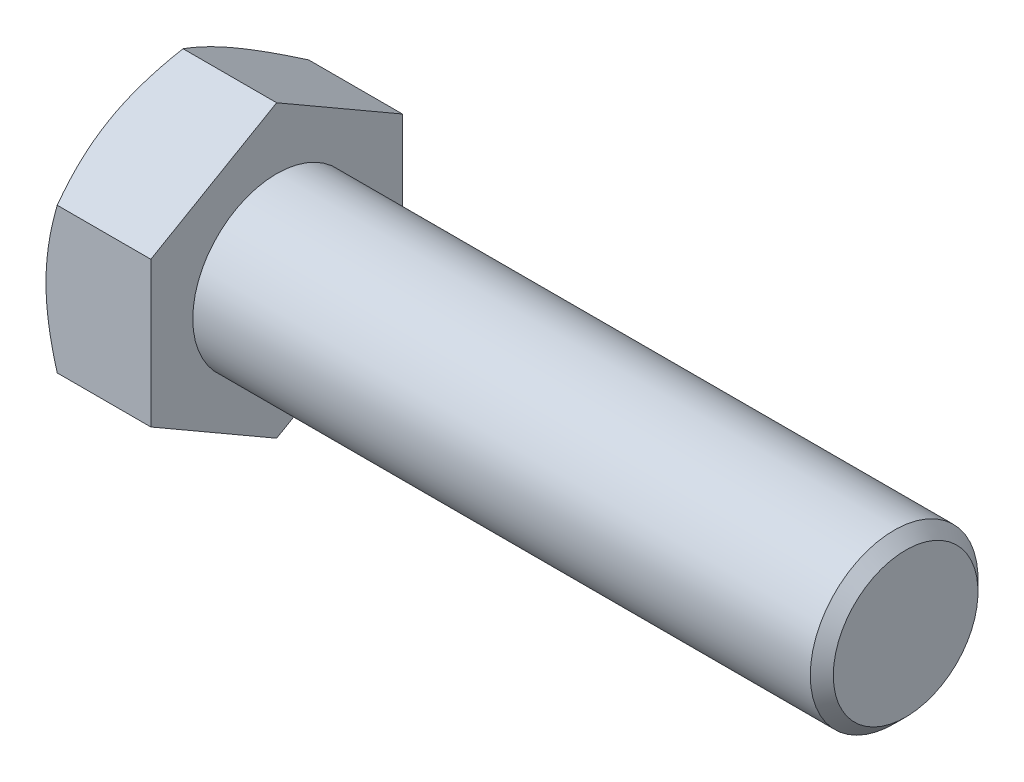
ISO-10303-21;
HEADER;
FILE_DESCRIPTION(('STEP AP214'),'2;1');
FILE_NAME('part.step','',(''),(''),'','','');
FILE_SCHEMA(('AUTOMOTIVE_DESIGN { 1 0 10303 214 1 1 1 1 }'));
ENDSEC;
DATA;
#1=APPLICATION_CONTEXT('core data for automotive mechanical design processes');
#2=APPLICATION_PROTOCOL_DEFINITION('international standard','automotive_design',2000,#1);
#3=PRODUCT_CONTEXT('',#1,'mechanical');
#4=PRODUCT('Part','Part','',(#3));
#5=PRODUCT_RELATED_PRODUCT_CATEGORY('part','',(#4));
#6=PRODUCT_DEFINITION_FORMATION('','',#4);
#7=PRODUCT_DEFINITION_CONTEXT('part definition',#1,'design');
#8=PRODUCT_DEFINITION('design','',#6,#7);
#9=PRODUCT_DEFINITION_SHAPE('','',#8);
#10=(LENGTH_UNIT() NAMED_UNIT(*) SI_UNIT(.MILLI.,.METRE.));
#11=(NAMED_UNIT(*) PLANE_ANGLE_UNIT() SI_UNIT($,.RADIAN.));
#12=(NAMED_UNIT(*) SI_UNIT($,.STERADIAN.) SOLID_ANGLE_UNIT());
#13=UNCERTAINTY_MEASURE_WITH_UNIT(LENGTH_MEASURE(1.E-05),#10,'distance_accuracy_value','');
#14=(GEOMETRIC_REPRESENTATION_CONTEXT(3) GLOBAL_UNCERTAINTY_ASSIGNED_CONTEXT((#13)) GLOBAL_UNIT_ASSIGNED_CONTEXT((#10,
#11,#12)) REPRESENTATION_CONTEXT('',''));
#15=CARTESIAN_POINT('',(0.,0.,0.));
#16=DIRECTION('',(0.,0.,1.));
#17=DIRECTION('',(1.,0.,0.));
#18=AXIS2_PLACEMENT_3D('',#15,#16,#17);
#19=CARTESIAN_POINT('',(15.,31.1769145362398,18.));
#20=DIRECTION('',(1.,0.,0.));
#21=DIRECTION('',(0.,0.,-1.));
#22=AXIS2_PLACEMENT_3D('',#19,#20,#21);
#23=PLANE('',#22);
#24=DIRECTION('',(0.,0.5,0.866025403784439));
#25=VECTOR('',#24,1.);
#26=CARTESIAN_POINT('',(15.,10.3923048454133,-18.));
#27=LINE('',#26,#25);
#28=CARTESIAN_POINT('',(15.,10.3923048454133,-18.));
#29=VERTEX_POINT('',#28);
#30=CARTESIAN_POINT('',(15.,20.7846096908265,0.));
#31=VERTEX_POINT('',#30);
#32=EDGE_CURVE('E150',#29,#31,#27,.T.);
#33=ORIENTED_EDGE('',*,*,#32,.T.);
#34=DIRECTION('',(0.,-0.5,0.866025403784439));
#35=VECTOR('',#34,1.);
#36=CARTESIAN_POINT('',(15.,20.7846096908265,0.));
#37=LINE('',#36,#35);
#38=CARTESIAN_POINT('',(15.,10.3923048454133,18.));
#39=VERTEX_POINT('',#38);
#40=EDGE_CURVE('E148',#31,#39,#37,.T.);
#41=ORIENTED_EDGE('',*,*,#40,.T.);
#42=DIRECTION('',(0.,-1.,0.));
#43=VECTOR('',#42,1.);
#44=CARTESIAN_POINT('',(15.,10.3923048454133,18.));
#45=LINE('',#44,#43);
#46=CARTESIAN_POINT('',(15.,-10.3923048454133,18.));
#47=VERTEX_POINT('',#46);
#48=EDGE_CURVE('E125',#39,#47,#45,.T.);
#49=ORIENTED_EDGE('',*,*,#48,.T.);
#50=DIRECTION('',(0.,-0.5,-0.866025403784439));
#51=VECTOR('',#50,1.);
#52=CARTESIAN_POINT('',(15.,-10.3923048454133,18.));
#53=LINE('',#52,#51);
#54=CARTESIAN_POINT('',(15.,-20.7846096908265,0.));
#55=VERTEX_POINT('',#54);
#56=EDGE_CURVE('E145',#47,#55,#53,.T.);
#57=ORIENTED_EDGE('',*,*,#56,.T.);
#58=DIRECTION('',(0.,0.5,-0.866025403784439));
#59=VECTOR('',#58,1.);
#60=CARTESIAN_POINT('',(15.,-20.7846096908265,0.));
#61=LINE('',#60,#59);
#62=CARTESIAN_POINT('',(15.,-10.3923048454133,-18.));
#63=VERTEX_POINT('',#62);
#64=EDGE_CURVE('E143',#55,#63,#61,.T.);
#65=ORIENTED_EDGE('',*,*,#64,.T.);
#66=DIRECTION('',(0.,1.,0.));
#67=VECTOR('',#66,1.);
#68=CARTESIAN_POINT('',(15.,-10.3923048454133,-18.));
#69=LINE('',#68,#67);
#70=EDGE_CURVE('E141',#63,#29,#69,.T.);
#71=ORIENTED_EDGE('',*,*,#70,.T.);
#72=EDGE_LOOP('',(#33,#41,#49,#57,#65,#71));
#73=FACE_BOUND('',#72,.T.);
#74=CARTESIAN_POINT('',(15.,0.,0.));
#75=DIRECTION('',(1.,0.,0.));
#76=DIRECTION('',(0.,0.,-1.));
#77=AXIS2_PLACEMENT_3D('',#74,#75,#76);
#78=CIRCLE('',#77,12.);
#79=CARTESIAN_POINT('',(15.,0.,-12.));
#80=VERTEX_POINT('',#79);
#81=EDGE_CURVE('E237',#80,#80,#78,.F.);
#82=ORIENTED_EDGE('',*,*,#81,.T.);
#83=EDGE_LOOP('',(#82));
#84=FACE_BOUND('',#83,.T.);
#85=ADVANCED_FACE('F32',(#73,#84),#23,.T.);
#86=CARTESIAN_POINT('',(15.,10.3923048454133,-18.));
#87=DIRECTION('',(0.,-0.866025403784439,0.5));
#88=DIRECTION('',(0.,-0.5,-0.866025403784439));
#89=AXIS2_PLACEMENT_3D('',#86,#87,#88);
#90=PLANE('',#89);
#91=CARTESIAN_POINT('',(1.60776182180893,20.7847251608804,0.000199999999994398));
#92=CARTESIAN_POINT('',(1.47589336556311,20.5563065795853,-0.395432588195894));
#93=CARTESIAN_POINT('',(1.35000889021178,20.3269970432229,-0.792608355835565));
#94=CARTESIAN_POINT('',(1.11187123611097,19.8665391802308,-1.59014476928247));
#95=CARTESIAN_POINT('',(0.999622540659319,19.6353902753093,-1.99050641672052));
#96=CARTESIAN_POINT('',(0.790265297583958,19.1708069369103,-2.79518836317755));
#97=CARTESIAN_POINT('',(0.693192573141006,18.9373684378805,-3.19951570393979));
#98=CARTESIAN_POINT('',(0.516271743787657,18.4688693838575,-4.01097986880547));
#99=CARTESIAN_POINT('',(0.436422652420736,18.2338089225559,-4.41811653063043));
#100=CARTESIAN_POINT('',(0.297345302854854,17.7680889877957,-5.22476711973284));
#101=CARTESIAN_POINT('',(0.237656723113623,17.537464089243,-5.62422116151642));
#102=CARTESIAN_POINT('',(0.137572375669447,17.0751575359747,-6.42495960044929));
#103=CARTESIAN_POINT('',(0.0971769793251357,16.8434758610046,-6.82624403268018));
#104=CARTESIAN_POINT('',(0.0366989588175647,16.3797233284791,-7.62948698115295));
#105=CARTESIAN_POINT('',(0.0165921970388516,16.1476532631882,-8.03144412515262));
#106=CARTESIAN_POINT('',(-0.00287614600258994,15.6832989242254,-8.83572943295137));
#107=CARTESIAN_POINT('',(-0.00223836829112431,15.4510146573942,-9.23805758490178));
#108=CARTESIAN_POINT('',(0.0183335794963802,15.0167538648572,-9.99021934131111));
#109=CARTESIAN_POINT('',(0.0357591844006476,14.8147463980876,-10.3401065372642));
#110=CARTESIAN_POINT('',(0.0859690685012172,14.4112133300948,-11.0390463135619));
#111=CARTESIAN_POINT('',(0.118753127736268,14.209687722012,-11.3880989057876));
#112=CARTESIAN_POINT('',(0.199111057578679,13.8071947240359,-12.0852372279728));
#113=CARTESIAN_POINT('',(0.246698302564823,13.6062280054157,-12.4333217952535));
#114=CARTESIAN_POINT('',(0.355822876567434,13.2052512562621,-13.1278338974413));
#115=CARTESIAN_POINT('',(0.417360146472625,13.0052412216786,-13.4742614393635));
#116=CARTESIAN_POINT('',(0.62446207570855,12.3980849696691,-14.525886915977));
#117=CARTESIAN_POINT('',(0.790677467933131,11.99269701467,-15.228039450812));
#118=CARTESIAN_POINT('',(1.16791817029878,11.1879658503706,-16.6218747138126));
#119=CARTESIAN_POINT('',(1.37885488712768,10.78861233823,-17.3135752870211));
#120=CARTESIAN_POINT('',(1.60776182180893,10.3921893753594,-18.0002));
#121=B_SPLINE_CURVE_WITH_KNOTS('',3,(#91,#92,#93,#94,#95,#96,#97,#98,#99,#100,#101,#102,#103,
#104,#105,#106,#107,#108,#109,#110,#111,#112,#113,#114,#115,#116,#117,#118,#119,#120),
.UNSPECIFIED.,.F.,.F.,(4,2,2,2,2,2,2,2,2,2,2,2,2,2,4),(0.,1.42650335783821,2.85347447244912,
4.28376471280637,5.71397301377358,7.10888071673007,8.5038152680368,9.89708828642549,
11.2903182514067,12.5031974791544,13.7160593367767,14.9300201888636,16.1439758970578,
18.6253607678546,21.1018751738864),.UNSPECIFIED.);
#122=CARTESIAN_POINT('',(1.60769515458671,20.7846096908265,0.));
#123=VERTEX_POINT('',#122);
#124=CARTESIAN_POINT('',(0.,15.5884572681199,-9.));
#125=VERTEX_POINT('',#124);
#126=EDGE_CURVE('E49',#123,#125,#121,.T.);
#127=ORIENTED_EDGE('',*,*,#126,.F.);
#128=DIRECTION('',(-1.,0.,0.));
#129=VECTOR('',#128,1.);
#130=CARTESIAN_POINT('',(15.,20.7846096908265,0.));
#131=LINE('',#130,#129);
#132=EDGE_CURVE('E126',#31,#123,#131,.T.);
#133=ORIENTED_EDGE('',*,*,#132,.F.);
#134=ORIENTED_EDGE('',*,*,#32,.F.);
#135=DIRECTION('',(-1.,0.,0.));
#136=VECTOR('',#135,1.);
#137=CARTESIAN_POINT('',(15.,10.3923048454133,-18.));
#138=LINE('',#137,#136);
#139=CARTESIAN_POINT('',(1.60769515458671,10.3923048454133,-18.));
#140=VERTEX_POINT('',#139);
#141=EDGE_CURVE('E138',#29,#140,#138,.T.);
#142=ORIENTED_EDGE('',*,*,#141,.T.);
#143=EDGE_CURVE('E193',#125,#140,#121,.T.);
#144=ORIENTED_EDGE('',*,*,#143,.F.);
#145=EDGE_LOOP('',(#127,#133,#134,#142,#144));
#146=FACE_BOUND('',#145,.T.);
#147=ADVANCED_FACE('F34',(#146),#90,.F.);
#148=CARTESIAN_POINT('',(15.,20.7846096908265,0.));
#149=DIRECTION('',(0.,-0.866025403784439,-0.5));
#150=DIRECTION('',(0.,0.5,-0.866025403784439));
#151=AXIS2_PLACEMENT_3D('',#148,#149,#150);
#152=PLANE('',#151);
#153=CARTESIAN_POINT('',(1.60776182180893,10.3921893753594,18.0002));
#154=CARTESIAN_POINT('',(1.47589336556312,10.6206079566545,17.6045674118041));
#155=CARTESIAN_POINT('',(1.35000889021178,10.8499174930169,17.2073916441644));
#156=CARTESIAN_POINT('',(1.11187123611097,11.310375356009,16.4098552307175));
#157=CARTESIAN_POINT('',(0.999622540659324,11.5415242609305,16.0094935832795));
#158=CARTESIAN_POINT('',(0.790265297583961,12.0061075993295,15.2048116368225));
#159=CARTESIAN_POINT('',(0.693192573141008,12.2395460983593,14.8004842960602));
#160=CARTESIAN_POINT('',(0.51627174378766,12.7080451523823,13.9890201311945));
#161=CARTESIAN_POINT('',(0.436422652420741,12.9431056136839,13.5818834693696));
#162=CARTESIAN_POINT('',(0.297345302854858,13.4088255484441,12.7752328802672));
#163=CARTESIAN_POINT('',(0.237656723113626,13.6394504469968,12.3757788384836));
#164=CARTESIAN_POINT('',(0.137572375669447,14.1017570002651,11.5750403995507));
#165=CARTESIAN_POINT('',(0.0971769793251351,14.3334386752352,11.1737559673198));
#166=CARTESIAN_POINT('',(0.0366989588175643,14.7971912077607,10.3705130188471));
#167=CARTESIAN_POINT('',(0.0165921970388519,15.0292612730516,9.96855587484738));
#168=CARTESIAN_POINT('',(-0.00287614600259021,15.4936156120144,9.16427056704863));
#169=CARTESIAN_POINT('',(-0.0022383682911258,15.7258998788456,8.76194241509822));
#170=CARTESIAN_POINT('',(0.0183335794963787,16.1601606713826,8.00978065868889));
#171=CARTESIAN_POINT('',(0.035759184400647,16.3621681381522,7.65989346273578));
#172=CARTESIAN_POINT('',(0.0859690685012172,16.765701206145,6.96095368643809));
#173=CARTESIAN_POINT('',(0.118753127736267,16.9672268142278,6.61190109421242));
#174=CARTESIAN_POINT('',(0.199111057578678,17.3697198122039,5.91476277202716));
#175=CARTESIAN_POINT('',(0.246698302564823,17.5706865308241,5.56667820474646));
#176=CARTESIAN_POINT('',(0.355822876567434,17.9716632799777,4.87216610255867));
#177=CARTESIAN_POINT('',(0.417360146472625,18.1716733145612,4.52573856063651));
#178=CARTESIAN_POINT('',(0.624462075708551,18.7788295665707,3.47411308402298));
#179=CARTESIAN_POINT('',(0.790677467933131,19.1842175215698,2.77196054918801));
#180=CARTESIAN_POINT('',(1.16791817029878,19.9889486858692,1.37812528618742));
#181=CARTESIAN_POINT('',(1.37885488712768,20.3883021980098,0.68642471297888));
#182=CARTESIAN_POINT('',(1.60776182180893,20.7847251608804,-0.000200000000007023));
#183=B_SPLINE_CURVE_WITH_KNOTS('',3,(#153,#154,#155,#156,#157,#158,#159,#160,#161,#162,#163,
#164,#165,#166,#167,#168,#169,#170,#171,#172,#173,#174,#175,#176,#177,#178,#179,#180,#181,#182),
.UNSPECIFIED.,.F.,.F.,(4,2,2,2,2,2,2,2,2,2,2,2,2,2,4),(0.,1.42650335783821,2.85347447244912,
4.28376471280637,5.71397301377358,7.10888071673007,8.5038152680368,9.89708828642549,
11.2903182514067,12.5031974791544,13.7160593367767,14.9300201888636,16.1439758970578,
18.6253607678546,21.1018751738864),.UNSPECIFIED.);
#184=CARTESIAN_POINT('',(1.60769515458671,10.3923048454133,18.));
#185=VERTEX_POINT('',#184);
#186=CARTESIAN_POINT('',(0.,15.5884572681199,8.99999999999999));
#187=VERTEX_POINT('',#186);
#188=EDGE_CURVE('E56',#185,#187,#183,.T.);
#189=ORIENTED_EDGE('',*,*,#188,.F.);
#190=DIRECTION('',(-1.,0.,0.));
#191=VECTOR('',#190,1.);
#192=CARTESIAN_POINT('',(15.,10.3923048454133,18.));
#193=LINE('',#192,#191);
#194=EDGE_CURVE('E118',#39,#185,#193,.T.);
#195=ORIENTED_EDGE('',*,*,#194,.F.);
#196=ORIENTED_EDGE('',*,*,#40,.F.);
#197=ORIENTED_EDGE('',*,*,#132,.T.);
#198=EDGE_CURVE('E121',#187,#123,#183,.T.);
#199=ORIENTED_EDGE('',*,*,#198,.F.);
#200=EDGE_LOOP('',(#189,#195,#196,#197,#199));
#201=FACE_BOUND('',#200,.T.);
#202=ADVANCED_FACE('F117',(#201),#152,.F.);
#203=CARTESIAN_POINT('',(15.,10.3923048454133,18.));
#204=DIRECTION('',(0.,0.,-1.));
#205=DIRECTION('',(-1.,0.,0.));
#206=AXIS2_PLACEMENT_3D('',#203,#204,#205);
#207=PLANE('',#206);
#208=CARTESIAN_POINT('',(8.61348069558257,-27.5619239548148,18.));
#209=CARTESIAN_POINT('',(8.42247770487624,-27.1667877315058,18.));
#210=CARTESIAN_POINT('',(8.23246323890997,-26.7711739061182,18.));
#211=CARTESIAN_POINT('',(7.85463825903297,-25.978890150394,18.));
#212=CARTESIAN_POINT('',(7.66682776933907,-25.5822202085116,18.));
#213=CARTESIAN_POINT('',(7.10698821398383,-24.3903587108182,18.));
#214=CARTESIAN_POINT('',(6.73861331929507,-23.5934439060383,18.));
#215=CARTESIAN_POINT('',(6.0118783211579,-21.9895471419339,18.));
#216=CARTESIAN_POINT('',(5.65358759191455,-21.1825336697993,18.));
#217=CARTESIAN_POINT('',(4.95238944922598,-19.5618746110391,18.));
#218=CARTESIAN_POINT('',(4.60948123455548,-18.7482293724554,18.));
#219=CARTESIAN_POINT('',(3.93907746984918,-17.1029123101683,18.));
#220=CARTESIAN_POINT('',(3.61182282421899,-16.2711418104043,18.));
#221=CARTESIAN_POINT('',(2.98294292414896,-14.597784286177,18.));
#222=CARTESIAN_POINT('',(2.68132051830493,-13.7561961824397,18.));
#223=CARTESIAN_POINT('',(2.11181367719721,-12.0636207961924,18.));
#224=CARTESIAN_POINT('',(1.84385751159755,-11.2126578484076,18.));
#225=CARTESIAN_POINT('',(1.35037221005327,-9.49855213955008,18.));
#226=CARTESIAN_POINT('',(1.12482967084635,-8.63541331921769,18.));
#227=CARTESIAN_POINT('',(0.826582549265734,-7.33140916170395,18.));
#228=CARTESIAN_POINT('',(0.733829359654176,-6.89509921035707,18.));
#229=CARTESIAN_POINT('',(0.563143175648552,-6.01957542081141,18.));
#230=CARTESIAN_POINT('',(0.485209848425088,-5.58036164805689,18.));
#231=CARTESIAN_POINT('',(0.345545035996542,-4.6993249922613,18.));
#232=CARTESIAN_POINT('',(0.283814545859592,-4.25750195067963,18.));
#233=CARTESIAN_POINT('',(0.177795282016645,-3.37175302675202,18.));
#234=CARTESIAN_POINT('',(0.133506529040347,-2.92782714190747,18.));
#235=CARTESIAN_POINT('',(0.063563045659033,-2.04133804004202,18.));
#236=CARTESIAN_POINT('',(0.0377917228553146,-1.598784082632,18.));
#237=CARTESIAN_POINT('',(0.0050185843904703,-0.712983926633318,18.));
#238=CARTESIAN_POINT('',(-0.00198351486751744,-0.269737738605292,18.));
#239=CARTESIAN_POINT('',(0.00294785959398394,0.616528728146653,18.));
#240=CARTESIAN_POINT('',(0.0148760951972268,1.05954903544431,18.));
#241=CARTESIAN_POINT('',(0.0573715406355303,1.9446967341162,18.));
#242=CARTESIAN_POINT('',(0.0879395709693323,2.38682408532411,18.));
#243=CARTESIAN_POINT('',(0.183949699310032,3.45808110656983,18.));
#244=CARTESIAN_POINT('',(0.258712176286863,4.08639173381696,18.));
#245=CARTESIAN_POINT('',(0.441718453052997,5.33809089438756,18.));
#246=CARTESIAN_POINT('',(0.549967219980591,5.96147868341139,18.));
#247=CARTESIAN_POINT('',(0.919513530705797,7.82534534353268,18.));
#248=CARTESIAN_POINT('',(1.22536507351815,9.05709271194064,18.));
#249=CARTESIAN_POINT('',(1.75275444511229,10.8995809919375,18.));
#250=CARTESIAN_POINT('',(1.94256699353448,11.5199484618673,18.));
#251=CARTESIAN_POINT('',(2.34111719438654,12.7546900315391,18.));
#252=CARTESIAN_POINT('',(2.54985655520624,13.3690635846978,18.));
#253=CARTESIAN_POINT('',(2.98181266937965,14.5887549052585,18.));
#254=CARTESIAN_POINT('',(3.20494114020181,15.1941042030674,18.));
#255=CARTESIAN_POINT('',(3.54929436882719,16.0983156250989,18.));
#256=CARTESIAN_POINT('',(3.66566915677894,16.3990354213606,18.));
#257=CARTESIAN_POINT('',(3.90137756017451,16.9993068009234,18.));
#258=CARTESIAN_POINT('',(4.0207111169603,17.298858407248,18.));
#259=CARTESIAN_POINT('',(4.14139052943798,17.5978664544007,18.));
#260=B_SPLINE_CURVE_WITH_KNOTS('',3,(#208,#209,#210,#211,#212,#213,#214,#215,#216,#217,#218,
#219,#220,#221,#222,#223,#224,#225,#226,#227,#228,#229,#230,#231,#232,#233,#234,#235,#236,#237,
#238,#239,#240,#241,#242,#243,#244,#245,#246,#247,#248,#249,#250,#251,#252,#253,#254,#255,#256,
#257,#258,#259),.UNSPECIFIED.,.F.,.F.,(4,2,2,2,2,2,2,2,2,2,2,2,2,2,2,2,2,2,2,2,2,2,2,2,2,4),(0.,
1.3166344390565,2.6332833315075,5.26700924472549,7.91580691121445,10.5644664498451,
13.2456434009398,15.9271179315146,18.6027786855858,21.2775924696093,22.6155612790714,
23.9535000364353,25.2915209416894,26.6295434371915,27.9590656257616,29.2885677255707,
30.6177020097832,31.9468948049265,33.8440459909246,35.7414787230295,39.5436531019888,
41.4897689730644,43.4360606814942,45.3713764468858,46.3387197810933,47.3060439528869),.UNSPECIFIED.);
#261=CARTESIAN_POINT('',(1.60769515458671,-10.3923048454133,18.));
#262=VERTEX_POINT('',#261);
#263=CARTESIAN_POINT('',(0.,0.,18.));
#264=VERTEX_POINT('',#263);
#265=EDGE_CURVE('E111',#262,#264,#260,.T.);
#266=ORIENTED_EDGE('',*,*,#265,.F.);
#267=DIRECTION('',(-1.,0.,0.));
#268=VECTOR('',#267,1.);
#269=CARTESIAN_POINT('',(15.,-10.3923048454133,18.));
#270=LINE('',#269,#268);
#271=EDGE_CURVE('E127',#47,#262,#270,.T.);
#272=ORIENTED_EDGE('',*,*,#271,.F.);
#273=ORIENTED_EDGE('',*,*,#48,.F.);
#274=ORIENTED_EDGE('',*,*,#194,.T.);
#275=EDGE_CURVE('E103',#264,#185,#260,.T.);
#276=ORIENTED_EDGE('',*,*,#275,.F.);
#277=EDGE_LOOP('',(#266,#272,#273,#274,#276));
#278=FACE_BOUND('',#277,.T.);
#279=ADVANCED_FACE('F123',(#278),#207,.F.);
#280=CARTESIAN_POINT('',(15.,-10.3923048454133,18.));
#281=DIRECTION('',(0.,0.866025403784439,-0.5));
#282=DIRECTION('',(0.,0.5,0.866025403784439));
#283=AXIS2_PLACEMENT_3D('',#280,#281,#282);
#284=PLANE('',#283);
#285=CARTESIAN_POINT('',(1.60776182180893,-20.7847251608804,-0.000199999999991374));
#286=CARTESIAN_POINT('',(1.47589336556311,-20.5563065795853,0.395432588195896));
#287=CARTESIAN_POINT('',(1.35000889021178,-20.3269970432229,0.792608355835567));
#288=CARTESIAN_POINT('',(1.11187123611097,-19.8665391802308,1.59014476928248));
#289=CARTESIAN_POINT('',(0.999622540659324,-19.6353902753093,1.99050641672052));
#290=CARTESIAN_POINT('',(0.790265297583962,-19.1708069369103,2.79518836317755));
#291=CARTESIAN_POINT('',(0.693192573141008,-18.9373684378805,3.19951570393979));
#292=CARTESIAN_POINT('',(0.51627174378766,-18.4688693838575,4.01097986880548));
#293=CARTESIAN_POINT('',(0.436422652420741,-18.2338089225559,4.41811653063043));
#294=CARTESIAN_POINT('',(0.29734530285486,-17.7680889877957,5.22476711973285));
#295=CARTESIAN_POINT('',(0.237656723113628,-17.537464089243,5.62422116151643));
#296=CARTESIAN_POINT('',(0.137572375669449,-17.0751575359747,6.42495960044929));
#297=CARTESIAN_POINT('',(0.0971769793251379,-16.8434758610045,6.82624403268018));
#298=CARTESIAN_POINT('',(0.0366989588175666,-16.3797233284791,7.62948698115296));
#299=CARTESIAN_POINT('',(0.0165921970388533,-16.1476532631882,8.03144412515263));
#300=CARTESIAN_POINT('',(-0.00287614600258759,-15.6832989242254,8.83572943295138));
#301=CARTESIAN_POINT('',(-0.00223836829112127,-15.4510146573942,9.23805758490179));
#302=CARTESIAN_POINT('',(0.0183335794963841,-15.0167538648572,9.99021934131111));
#303=CARTESIAN_POINT('',(0.0357591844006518,-14.8147463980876,10.3401065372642));
#304=CARTESIAN_POINT('',(0.0859690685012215,-14.4112133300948,11.0390463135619));
#305=CARTESIAN_POINT('',(0.118753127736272,-14.209687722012,11.3880989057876));
#306=CARTESIAN_POINT('',(0.199111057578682,-13.8071947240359,12.0852372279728));
#307=CARTESIAN_POINT('',(0.246698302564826,-13.6062280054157,12.4333217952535));
#308=CARTESIAN_POINT('',(0.355822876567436,-13.2052512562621,13.1278338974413));
#309=CARTESIAN_POINT('',(0.417360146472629,-13.0052412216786,13.4742614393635));
#310=CARTESIAN_POINT('',(0.624462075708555,-12.3980849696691,14.525886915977));
#311=CARTESIAN_POINT('',(0.790677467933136,-11.99269701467,15.228039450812));
#312=CARTESIAN_POINT('',(1.16791817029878,-11.1879658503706,16.6218747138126));
#313=CARTESIAN_POINT('',(1.37885488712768,-10.78861233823,17.3135752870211));
#314=CARTESIAN_POINT('',(1.60776182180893,-10.3921893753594,18.0002));
#315=B_SPLINE_CURVE_WITH_KNOTS('',3,(#285,#286,#287,#288,#289,#290,#291,#292,#293,#294,#295,
#296,#297,#298,#299,#300,#301,#302,#303,#304,#305,#306,#307,#308,#309,#310,#311,#312,#313,#314),
.UNSPECIFIED.,.F.,.F.,(4,2,2,2,2,2,2,2,2,2,2,2,2,2,4),(0.,1.42650335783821,2.85347447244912,
4.28376471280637,5.71397301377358,7.10888071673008,8.5038152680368,9.8970882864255,
11.2903182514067,12.5031974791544,13.7160593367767,14.9300201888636,16.1439758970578,
18.6253607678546,21.1018751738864),.UNSPECIFIED.);
#316=CARTESIAN_POINT('',(1.60769515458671,-20.7846096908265,0.));
#317=VERTEX_POINT('',#316);
#318=CARTESIAN_POINT('',(0.,-15.5884572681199,9.));
#319=VERTEX_POINT('',#318);
#320=EDGE_CURVE('E197',#317,#319,#315,.T.);
#321=ORIENTED_EDGE('',*,*,#320,.F.);
#322=DIRECTION('',(-1.,0.,0.));
#323=VECTOR('',#322,1.);
#324=CARTESIAN_POINT('',(15.,-20.7846096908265,0.));
#325=LINE('',#324,#323);
#326=EDGE_CURVE('E130',#55,#317,#325,.T.);
#327=ORIENTED_EDGE('',*,*,#326,.F.);
#328=ORIENTED_EDGE('',*,*,#56,.F.);
#329=ORIENTED_EDGE('',*,*,#271,.T.);
#330=EDGE_CURVE('E112',#319,#262,#315,.T.);
#331=ORIENTED_EDGE('',*,*,#330,.F.);
#332=EDGE_LOOP('',(#321,#327,#328,#329,#331));
#333=FACE_BOUND('',#332,.T.);
#334=ADVANCED_FACE('F202',(#333),#284,.F.);
#335=CARTESIAN_POINT('',(15.,-20.7846096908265,0.));
#336=DIRECTION('',(0.,0.866025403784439,0.5));
#337=DIRECTION('',(0.,-0.5,0.866025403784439));
#338=AXIS2_PLACEMENT_3D('',#335,#336,#337);
#339=PLANE('',#338);
#340=CARTESIAN_POINT('',(1.60776182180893,-10.3921893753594,-18.0002));
#341=CARTESIAN_POINT('',(1.47589336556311,-10.6206079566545,-17.6045674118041));
#342=CARTESIAN_POINT('',(1.35000889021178,-10.8499174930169,-17.2073916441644));
#343=CARTESIAN_POINT('',(1.11187123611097,-11.310375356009,-16.4098552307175));
#344=CARTESIAN_POINT('',(0.999622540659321,-11.5415242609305,-16.0094935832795));
#345=CARTESIAN_POINT('',(0.790265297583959,-12.0061075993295,-15.2048116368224));
#346=CARTESIAN_POINT('',(0.693192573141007,-12.2395460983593,-14.8004842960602));
#347=CARTESIAN_POINT('',(0.51627174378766,-12.7080451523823,-13.9890201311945));
#348=CARTESIAN_POINT('',(0.43642265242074,-12.9431056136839,-13.5818834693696));
#349=CARTESIAN_POINT('',(0.297345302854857,-13.4088255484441,-12.7752328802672));
#350=CARTESIAN_POINT('',(0.237656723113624,-13.6394504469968,-12.3757788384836));
#351=CARTESIAN_POINT('',(0.137572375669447,-14.1017570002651,-11.5750403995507));
#352=CARTESIAN_POINT('',(0.0971769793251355,-14.3334386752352,-11.1737559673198));
#353=CARTESIAN_POINT('',(0.036698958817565,-14.7971912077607,-10.370513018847));
#354=CARTESIAN_POINT('',(0.0165921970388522,-15.0292612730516,-9.96855587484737));
#355=CARTESIAN_POINT('',(-0.0028761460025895,-15.4936156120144,-9.16427056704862));
#356=CARTESIAN_POINT('',(-0.00223836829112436,-15.7258998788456,-8.76194241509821));
#357=CARTESIAN_POINT('',(0.0183335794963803,-16.1601606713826,-8.00978065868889));
#358=CARTESIAN_POINT('',(0.0357591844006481,-16.3621681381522,-7.65989346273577));
#359=CARTESIAN_POINT('',(0.0859690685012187,-16.765701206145,-6.96095368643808));
#360=CARTESIAN_POINT('',(0.11875312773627,-16.9672268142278,-6.61190109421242));
#361=CARTESIAN_POINT('',(0.199111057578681,-17.3697198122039,-5.91476277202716));
#362=CARTESIAN_POINT('',(0.246698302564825,-17.5706865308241,-5.56667820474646));
#363=CARTESIAN_POINT('',(0.355822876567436,-17.9716632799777,-4.87216610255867));
#364=CARTESIAN_POINT('',(0.417360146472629,-18.1716733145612,-4.5257385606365));
#365=CARTESIAN_POINT('',(0.624462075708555,-18.7788295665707,-3.47411308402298));
#366=CARTESIAN_POINT('',(0.790677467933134,-19.1842175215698,-2.77196054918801));
#367=CARTESIAN_POINT('',(1.16791817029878,-19.9889486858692,-1.37812528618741));
#368=CARTESIAN_POINT('',(1.37885488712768,-20.3883021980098,-0.686424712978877));
#369=CARTESIAN_POINT('',(1.60776182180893,-20.7847251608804,0.000200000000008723));
#370=B_SPLINE_CURVE_WITH_KNOTS('',3,(#340,#341,#342,#343,#344,#345,#346,#347,#348,#349,#350,
#351,#352,#353,#354,#355,#356,#357,#358,#359,#360,#361,#362,#363,#364,#365,#366,#367,#368,#369),
.UNSPECIFIED.,.F.,.F.,(4,2,2,2,2,2,2,2,2,2,2,2,2,2,4),(0.,1.42650335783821,2.85347447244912,
4.28376471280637,5.71397301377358,7.10888071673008,8.5038152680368,9.89708828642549,
11.2903182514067,12.5031974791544,13.7160593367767,14.9300201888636,16.1439758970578,
18.6253607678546,21.1018751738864),.UNSPECIFIED.);
#371=CARTESIAN_POINT('',(1.60769515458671,-10.3923048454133,-18.));
#372=VERTEX_POINT('',#371);
#373=CARTESIAN_POINT('',(0.,-15.5884572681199,-8.99999999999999));
#374=VERTEX_POINT('',#373);
#375=EDGE_CURVE('E186',#372,#374,#370,.T.);
#376=ORIENTED_EDGE('',*,*,#375,.F.);
#377=DIRECTION('',(-1.,0.,0.));
#378=VECTOR('',#377,1.);
#379=CARTESIAN_POINT('',(15.,-10.3923048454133,-18.));
#380=LINE('',#379,#378);
#381=EDGE_CURVE('E135',#63,#372,#380,.T.);
#382=ORIENTED_EDGE('',*,*,#381,.F.);
#383=ORIENTED_EDGE('',*,*,#64,.F.);
#384=ORIENTED_EDGE('',*,*,#326,.T.);
#385=EDGE_CURVE('E201',#374,#317,#370,.T.);
#386=ORIENTED_EDGE('',*,*,#385,.F.);
#387=EDGE_LOOP('',(#376,#382,#383,#384,#386));
#388=FACE_BOUND('',#387,.T.);
#389=ADVANCED_FACE('F205',(#388),#339,.F.);
#390=CARTESIAN_POINT('',(15.,-10.3923048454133,-18.));
#391=DIRECTION('',(0.,0.,1.));
#392=DIRECTION('',(0.,-1.,0.));
#393=AXIS2_PLACEMENT_3D('',#390,#391,#392);
#394=PLANE('',#393);
#395=CARTESIAN_POINT('',(8.61348069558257,-27.5619239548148,-18.));
#396=CARTESIAN_POINT('',(8.42247770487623,-27.1667877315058,-18.));
#397=CARTESIAN_POINT('',(8.23246323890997,-26.7711739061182,-18.));
#398=CARTESIAN_POINT('',(7.85463825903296,-25.978890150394,-18.));
#399=CARTESIAN_POINT('',(7.66682776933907,-25.5822202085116,-18.));
#400=CARTESIAN_POINT('',(7.10698821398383,-24.3903587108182,-18.));
#401=CARTESIAN_POINT('',(6.73861331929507,-23.5934439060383,-18.));
#402=CARTESIAN_POINT('',(6.0118783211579,-21.9895471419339,-18.));
#403=CARTESIAN_POINT('',(5.65358759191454,-21.1825336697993,-18.));
#404=CARTESIAN_POINT('',(4.95238944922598,-19.5618746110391,-18.));
#405=CARTESIAN_POINT('',(4.60948123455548,-18.7482293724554,-18.));
#406=CARTESIAN_POINT('',(3.93907746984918,-17.1029123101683,-18.));
#407=CARTESIAN_POINT('',(3.61182282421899,-16.2711418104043,-18.));
#408=CARTESIAN_POINT('',(2.98294292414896,-14.597784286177,-18.));
#409=CARTESIAN_POINT('',(2.68132051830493,-13.7561961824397,-18.));
#410=CARTESIAN_POINT('',(2.11181367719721,-12.0636207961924,-18.));
#411=CARTESIAN_POINT('',(1.84385751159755,-11.2126578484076,-18.));
#412=CARTESIAN_POINT('',(1.35037221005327,-9.49855213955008,-18.));
#413=CARTESIAN_POINT('',(1.12482967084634,-8.63541331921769,-18.));
#414=CARTESIAN_POINT('',(0.826582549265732,-7.33140916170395,-18.));
#415=CARTESIAN_POINT('',(0.733829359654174,-6.89509921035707,-18.));
#416=CARTESIAN_POINT('',(0.563143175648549,-6.01957542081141,-18.));
#417=CARTESIAN_POINT('',(0.485209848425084,-5.58036164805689,-18.));
#418=CARTESIAN_POINT('',(0.345545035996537,-4.6993249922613,-18.));
#419=CARTESIAN_POINT('',(0.283814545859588,-4.25750195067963,-18.));
#420=CARTESIAN_POINT('',(0.17779528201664,-3.37175302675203,-18.));
#421=CARTESIAN_POINT('',(0.133506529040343,-2.92782714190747,-18.));
#422=CARTESIAN_POINT('',(0.0635630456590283,-2.04133804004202,-18.));
#423=CARTESIAN_POINT('',(0.0377917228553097,-1.598784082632,-18.));
#424=CARTESIAN_POINT('',(0.0050185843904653,-0.712983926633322,-18.));
#425=CARTESIAN_POINT('',(-0.00198351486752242,-0.269737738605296,-18.));
#426=CARTESIAN_POINT('',(0.00294785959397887,0.616528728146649,-18.));
#427=CARTESIAN_POINT('',(0.0148760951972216,1.0595490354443,-18.));
#428=CARTESIAN_POINT('',(0.0573715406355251,1.9446967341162,-18.));
#429=CARTESIAN_POINT('',(0.0879395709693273,2.3868240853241,-18.));
#430=CARTESIAN_POINT('',(0.183949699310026,3.45808110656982,-18.));
#431=CARTESIAN_POINT('',(0.258712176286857,4.08639173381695,-18.));
#432=CARTESIAN_POINT('',(0.441718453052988,5.33809089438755,-18.));
#433=CARTESIAN_POINT('',(0.549967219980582,5.96147868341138,-18.));
#434=CARTESIAN_POINT('',(0.919513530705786,7.82534534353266,-18.));
#435=CARTESIAN_POINT('',(1.22536507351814,9.05709271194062,-18.));
#436=CARTESIAN_POINT('',(1.75275444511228,10.8995809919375,-18.));
#437=CARTESIAN_POINT('',(1.94256699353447,11.5199484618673,-18.));
#438=CARTESIAN_POINT('',(2.34111719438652,12.7546900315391,-18.));
#439=CARTESIAN_POINT('',(2.54985655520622,13.3690635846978,-18.));
#440=CARTESIAN_POINT('',(2.98181266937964,14.5887549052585,-18.));
#441=CARTESIAN_POINT('',(3.2049411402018,15.1941042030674,-18.));
#442=CARTESIAN_POINT('',(3.54929436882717,16.0983156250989,-18.));
#443=CARTESIAN_POINT('',(3.66566915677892,16.3990354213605,-18.));
#444=CARTESIAN_POINT('',(3.90137756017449,16.9993068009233,-18.));
#445=CARTESIAN_POINT('',(4.02071111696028,17.298858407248,-18.));
#446=CARTESIAN_POINT('',(4.14139052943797,17.5978664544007,-18.));
#447=B_SPLINE_CURVE_WITH_KNOTS('',3,(#395,#396,#397,#398,#399,#400,#401,#402,#403,#404,#405,
#406,#407,#408,#409,#410,#411,#412,#413,#414,#415,#416,#417,#418,#419,#420,#421,#422,#423,#424,
#425,#426,#427,#428,#429,#430,#431,#432,#433,#434,#435,#436,#437,#438,#439,#440,#441,#442,#443,
#444,#445,#446),.UNSPECIFIED.,.F.,.F.,(4,2,2,2,2,2,2,2,2,2,2,2,2,2,2,2,2,2,2,2,2,2,2,2,2,4),(0.,
1.3166344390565,2.6332833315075,5.26700924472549,7.91580691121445,10.5644664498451,
13.2456434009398,15.9271179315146,18.6027786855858,21.2775924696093,22.6155612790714,
23.9535000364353,25.2915209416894,26.6295434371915,27.9590656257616,29.2885677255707,
30.6177020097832,31.9468948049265,33.8440459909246,35.7414787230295,39.5436531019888,
41.4897689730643,43.4360606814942,45.3713764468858,46.3387197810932,47.3060439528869),.UNSPECIFIED.);
#448=CARTESIAN_POINT('',(0.,0.,-18.));
#449=VERTEX_POINT('',#448);
#450=EDGE_CURVE('E364',#140,#449,#447,.F.);
#451=ORIENTED_EDGE('',*,*,#450,.F.);
#452=ORIENTED_EDGE('',*,*,#141,.F.);
#453=ORIENTED_EDGE('',*,*,#70,.F.);
#454=ORIENTED_EDGE('',*,*,#381,.T.);
#455=EDGE_CURVE('E177',#449,#372,#447,.F.);
#456=ORIENTED_EDGE('',*,*,#455,.F.);
#457=EDGE_LOOP('',(#451,#452,#453,#454,#456));
#458=FACE_BOUND('',#457,.T.);
#459=ADVANCED_FACE('F209',(#458),#394,.F.);
#460=CARTESIAN_POINT('',(0.,0.,0.));
#461=DIRECTION('',(1.,0.,0.));
#462=DIRECTION('',(0.,0.,-1.));
#463=AXIS2_PLACEMENT_3D('',#460,#461,#462);
#464=CONICAL_SURFACE('',#463,18.,1.0471975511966);
#465=ORIENTED_EDGE('',*,*,#375,.T.);
#466=CARTESIAN_POINT('',(0.,0.,0.));
#467=DIRECTION('',(1.,0.,0.));
#468=DIRECTION('',(0.,0.,-1.));
#469=AXIS2_PLACEMENT_3D('',#466,#467,#468);
#470=CIRCLE('',#469,18.);
#471=EDGE_CURVE('E37',#374,#449,#470,.T.);
#472=ORIENTED_EDGE('',*,*,#471,.T.);
#473=ORIENTED_EDGE('',*,*,#455,.T.);
#474=EDGE_LOOP('',(#465,#472,#473));
#475=FACE_BOUND('',#474,.T.);
#476=ADVANCED_FACE('F170',(#475),#464,.T.);
#477=ORIENTED_EDGE('',*,*,#320,.T.);
#478=EDGE_CURVE('E366',#319,#374,#470,.T.);
#479=ORIENTED_EDGE('',*,*,#478,.T.);
#480=ORIENTED_EDGE('',*,*,#385,.T.);
#481=EDGE_LOOP('',(#477,#479,#480));
#482=FACE_BOUND('',#481,.T.);
#483=ADVANCED_FACE('F168',(#482),#464,.T.);
#484=ORIENTED_EDGE('',*,*,#265,.T.);
#485=EDGE_CURVE('E378',#264,#319,#470,.T.);
#486=ORIENTED_EDGE('',*,*,#485,.T.);
#487=ORIENTED_EDGE('',*,*,#330,.T.);
#488=EDGE_LOOP('',(#484,#486,#487));
#489=FACE_BOUND('',#488,.T.);
#490=ADVANCED_FACE('F163',(#489),#464,.T.);
#491=ORIENTED_EDGE('',*,*,#275,.T.);
#492=ORIENTED_EDGE('',*,*,#188,.T.);
#493=CARTESIAN_POINT('',(0.,0.,0.));
#494=DIRECTION('',(-1.,0.,0.));
#495=DIRECTION('',(0.,0.,1.));
#496=AXIS2_PLACEMENT_3D('',#493,#494,#495);
#497=CIRCLE('',#496,18.);
#498=EDGE_CURVE('E106',#264,#187,#497,.T.);
#499=ORIENTED_EDGE('',*,*,#498,.F.);
#500=EDGE_LOOP('',(#491,#492,#499));
#501=FACE_BOUND('',#500,.T.);
#502=ADVANCED_FACE('F104',(#501),#464,.T.);
#503=ORIENTED_EDGE('',*,*,#198,.T.);
#504=ORIENTED_EDGE('',*,*,#126,.T.);
#505=EDGE_CURVE('E42',#125,#187,#470,.T.);
#506=ORIENTED_EDGE('',*,*,#505,.T.);
#507=EDGE_LOOP('',(#503,#504,#506));
#508=FACE_BOUND('',#507,.T.);
#509=ADVANCED_FACE('F224',(#508),#464,.T.);
#510=ORIENTED_EDGE('',*,*,#143,.T.);
#511=ORIENTED_EDGE('',*,*,#450,.T.);
#512=EDGE_CURVE('E11',#449,#125,#470,.T.);
#513=ORIENTED_EDGE('',*,*,#512,.T.);
#514=EDGE_LOOP('',(#510,#511,#513));
#515=FACE_BOUND('',#514,.T.);
#516=ADVANCED_FACE('F216',(#515),#464,.T.);
#517=CARTESIAN_POINT('',(0.,31.1769145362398,18.));
#518=DIRECTION('',(1.,0.,0.));
#519=DIRECTION('',(0.,0.,-1.));
#520=AXIS2_PLACEMENT_3D('',#517,#518,#519);
#521=PLANE('',#520);
#522=ORIENTED_EDGE('',*,*,#512,.F.);
#523=ORIENTED_EDGE('',*,*,#471,.F.);
#524=ORIENTED_EDGE('',*,*,#478,.F.);
#525=ORIENTED_EDGE('',*,*,#485,.F.);
#526=ORIENTED_EDGE('',*,*,#498,.T.);
#527=ORIENTED_EDGE('',*,*,#505,.F.);
#528=EDGE_LOOP('',(#522,#523,#524,#525,#526,#527));
#529=FACE_BOUND('',#528,.T.);
#530=ADVANCED_FACE('F214',(#529),#521,.F.);
#531=CARTESIAN_POINT('',(0.,0.,0.));
#532=DIRECTION('',(-1.,0.,0.));
#533=DIRECTION('',(0.,0.,1.));
#534=AXIS2_PLACEMENT_3D('',#531,#532,#533);
#535=CYLINDRICAL_SURFACE('',#534,12.);
#536=ORIENTED_EDGE('',*,*,#81,.F.);
#537=EDGE_LOOP('',(#536));
#538=FACE_BOUND('',#537,.T.);
#539=CARTESIAN_POINT('',(103.352,0.,0.));
#540=DIRECTION('',(-1.,0.,0.));
#541=DIRECTION('',(0.,0.,1.));
#542=AXIS2_PLACEMENT_3D('',#539,#540,#541);
#543=CIRCLE('',#542,12.);
#544=CARTESIAN_POINT('',(103.352,0.,12.));
#545=VERTEX_POINT('',#544);
#546=EDGE_CURVE('E238',#545,#545,#543,.T.);
#547=ORIENTED_EDGE('',*,*,#546,.T.);
#548=EDGE_LOOP('',(#547));
#549=FACE_BOUND('',#548,.T.);
#550=ADVANCED_FACE('F171',(#538,#549),#535,.T.);
#551=CARTESIAN_POINT('',(105.,0.,0.));
#552=DIRECTION('',(-1.,0.,0.));
#553=DIRECTION('',(0.,0.,1.));
#554=AXIS2_PLACEMENT_3D('',#551,#552,#553);
#555=CONICAL_SURFACE('',#554,10.352,0.785398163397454);
#556=ORIENTED_EDGE('',*,*,#546,.F.);
#557=EDGE_LOOP('',(#556));
#558=FACE_BOUND('',#557,.T.);
#559=CARTESIAN_POINT('',(105.,0.,0.));
#560=DIRECTION('',(-1.,0.,0.));
#561=DIRECTION('',(0.,0.,1.));
#562=AXIS2_PLACEMENT_3D('',#559,#560,#561);
#563=CIRCLE('',#562,10.352);
#564=CARTESIAN_POINT('',(105.,0.,10.352));
#565=VERTEX_POINT('',#564);
#566=EDGE_CURVE('E241',#565,#565,#563,.T.);
#567=ORIENTED_EDGE('',*,*,#566,.T.);
#568=EDGE_LOOP('',(#567));
#569=FACE_BOUND('',#568,.T.);
#570=ADVANCED_FACE('F222',(#558,#569),#555,.T.);
#571=CARTESIAN_POINT('',(105.,10.352,0.));
#572=DIRECTION('',(-1.,0.,0.));
#573=DIRECTION('',(0.,0.,1.));
#574=AXIS2_PLACEMENT_3D('',#571,#572,#573);
#575=PLANE('',#574);
#576=ORIENTED_EDGE('',*,*,#566,.F.);
#577=EDGE_LOOP('',(#576));
#578=FACE_BOUND('',#577,.T.);
#579=ADVANCED_FACE('F248',(#578),#575,.F.);
#580=CLOSED_SHELL('',(#85,#147,#202,#279,#334,#389,#459,#476,#483,#490,#502,#509,#516,#530,#550,
#570,#579));
#581=MANIFOLD_SOLID_BREP('B2',#580);
#582=ADVANCED_BREP_SHAPE_REPRESENTATION('',(#18,#581),#14);
#583=SHAPE_DEFINITION_REPRESENTATION(#9,#582);
ENDSEC;
END-ISO-10303-21;
